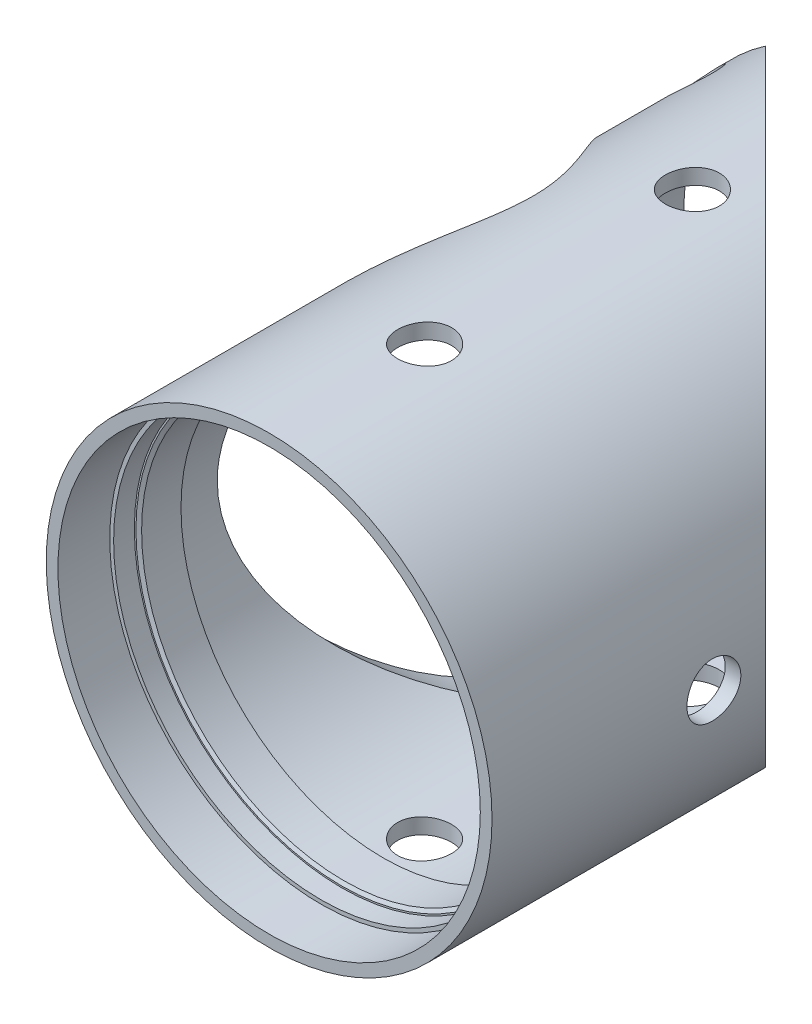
from build123d import *

# Parameters (mm, degrees)
SKETCH1_R               = 27.305
SKETCH1_R_2             = 22.225
RAW_TUBE_DEPTH          = 76.2
SKETCH2_R               = 24.765
SIDE_HOLE_DEPTH         = 38.1
SKETCH4_R               = 25.4
PCX_SEAT_DEPTH          = 8.89
MIRROR_BORE_START       = -62.23
SKETCH5_R               = 25.4
MIRROR_BORE_DEPTH       = 62.23
SKETCH6_R               = 24.765
BORE_1_95_DEPTH         = 20.32
PCX_CHAMFER_SIZE        = 0.254
PCX_CHAMFER_SIZE2       = 0.439940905
SKETCH7_R               = 25.87117
FEMALE_THREAD_ID_DEPTH  = 6.35
F_45DEG_CUT_DEPTH       = 38.1
F_45DEG_CUT_DEPTH_BACK  = 38.1
CUT_EXTRUDE3_REACH      = 102.757
CUT_EXTRUDE3_END_RADIUS = 25.4
SKETCH9_R               = 3.302
CUT_EXTRUDE6_DEPTH      = 86.425792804
CUT_EXTRUDE6_DEPTH_BACK = 86.425792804
SKETCH10_R              = 3.302
SKETCH11_R              = 3.302
CUT_EXTRUDE7_DEPTH      = 86.425792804
CUT_EXTRUDE8_DEPTH      = 86.425792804
CUT_EXTRUDE8_DEPTH_BACK = 86.425792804
SKETCH12_R              = 3.302


with BuildPart() as part:
    # Sketch1 → raw-tube (new body)
    with BuildSketch(Plane.XY):
        with Locations(Location((0, 0, 0), (0, 0, 180))):
            Circle(SKETCH1_R)
        with Locations(Location((0, 0, 0), (0, 0, 180))):
            Circle(SKETCH1_R_2, mode=Mode.SUBTRACT)
    extrude(amount=RAW_TUBE_DEPTH)

    # Sketch2 → side_hole (cut)
    with BuildSketch(Plane(origin=(0, 0, 0), x_dir=(0, 0, -1), z_dir=(1, 0, 0))):
        with Locations(Location((-32.385, 0, 0), (0, 0, 63.823047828))):
            Circle(SKETCH2_R)
    extrude(amount=-SIDE_HOLE_DEPTH, mode=Mode.SUBTRACT)

    # Sketch4 → pcx_seat (cut)
    with BuildSketch(Plane.XY.offset(76.2)):
        Circle(SKETCH4_R)
    extrude(amount=-PCX_SEAT_DEPTH, mode=Mode.SUBTRACT)

    # Sketch5 → mirror_bore (cut)
    with BuildSketch(Plane(origin=(0, 0, 0), x_dir=(-1, 0, 0), z_dir=(0, 0, -1)).offset(MIRROR_BORE_START)):
        with Locations(Location((0, 0, 0), (0, 0, 180))):
            Circle(SKETCH5_R)
    extrude(amount=MIRROR_BORE_DEPTH, mode=Mode.SUBTRACT)

    # Sketch6 → bore_1.95 (cut)
    with BuildSketch(Plane.XY.offset(67.31)):
        Circle(SKETCH6_R)
    extrude(amount=-BORE_1_95_DEPTH, mode=Mode.SUBTRACT)

    # pcx_chamfer
    pcx_chamfer_edges = [part.edges().sort_by_distance(p)[0] for p in [
        (-24.765, 0, 67.31),
    ]]
    pcx_chamfer_side = [part.faces().sort_by_distance(p)[0] for p in [
        (-24.765, 0, 64.77),
    ]]
    chamfer(pcx_chamfer_edges, length=PCX_CHAMFER_SIZE, length2=PCX_CHAMFER_SIZE2, reference=pcx_chamfer_side[0])

    # Sketch7 → female_thread_ID (cut)
    with BuildSketch(Plane.XY.offset(76.2)):
        Circle(SKETCH7_R)
    extrude(amount=-FEMALE_THREAD_ID_DEPTH, mode=Mode.SUBTRACT)

    # Sketch3 → 45deg_cut (cut, two sides: drawn at the far end of the back side and taken through both)
    with BuildSketch(Plane(origin=(0, 0, 0), x_dir=(1, 0, 0), z_dir=(0, 1, 0)).offset(-F_45DEG_CUT_DEPTH_BACK)):
        Polygon((-12.827, -2.54), (29.057392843, -44.424392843), (29.057392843, 0), (-12.827, 0), (-15.367, 0), align=None)
    extrude(amount=F_45DEG_CUT_DEPTH + F_45DEG_CUT_DEPTH_BACK, mode=Mode.SUBTRACT)

    # Cut-Extrude3: up to this cylinder (the profile starts outside it)
    cut_extrude3_end = Plane(origin=(0, 0, 5.08), z_dir=(0, 0, -1)) * Cylinder(CUT_EXTRUDE3_END_RADIUS, 257.314, mode=Mode.PRIVATE)
    # Sketch9 → Cut-Extrude3 (cut, up to the surface)
    with BuildSketch(Plane(origin=(-19.30755066, -19.30755066, 0), x_dir=(0, 0, -1), z_dir=(0.7071067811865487, 0.7071067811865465, 0)), mode=Mode.PRIVATE) as cut_extrude3_sk1:
        with Locations(Location((-5.08, 0, 0), (0, 0, 270))):
            Circle(SKETCH9_R)
    cut_extrude3_tool1 = extrude(cut_extrude3_sk1.sketch, amount=CUT_EXTRUDE3_REACH, mode=Mode.PRIVATE) - cut_extrude3_end
    cut_extrude3 = cut_extrude3_tool1.solids().sort_by_distance((-19.307551, -19.307551, 5.08))[0]
    add(cut_extrude3, mode=Mode.SUBTRACT)

    # Sketch10 → Cut-Extrude6 (cut, two sides: drawn at the far end of the back side and taken through both)
    with BuildSketch(Plane(origin=(0, 0, 0), x_dir=(1, 0, 0), z_dir=(0, 1, 0)).offset(-CUT_EXTRUDE6_DEPTH_BACK)):
        with Locations(Location((0, -24.347256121, 0), (0, 0, 270))):
            Circle(SKETCH10_R)
    extrude(amount=CUT_EXTRUDE6_DEPTH + CUT_EXTRUDE6_DEPTH_BACK, mode=Mode.SUBTRACT)

    # Sketch11 → Cut-Extrude7 (cut, through all)
    with BuildSketch(Plane(origin=(0, 0, 0), x_dir=(0, 0, -1), z_dir=(1, 0, 0))):
        with Locations(Location((-49.022, 0, 0), (0, 0, 180))):
            Circle(SKETCH11_R)
    extrude(amount=CUT_EXTRUDE7_DEPTH, mode=Mode.SUBTRACT)

    # Mirror1: Cut-Extrude3 across plane
    add(cut_extrude3.mirror(Plane.ZX), mode=Mode.SUBTRACT)

    # Sketch12 → Cut-Extrude8 (cut, two sides: drawn at the far end of the back side and taken through both)
    with BuildSketch(Plane(origin=(0, 0, 0), x_dir=(1, 0, 0), z_dir=(0, 1, 0)).offset(-CUT_EXTRUDE8_DEPTH_BACK)):
        with Locations(Location((0, -57.15, 0), (0, 0, 270))):
            Circle(SKETCH12_R)
    extrude(amount=CUT_EXTRUDE8_DEPTH + CUT_EXTRUDE8_DEPTH_BACK, mode=Mode.SUBTRACT)


solid = part.part
